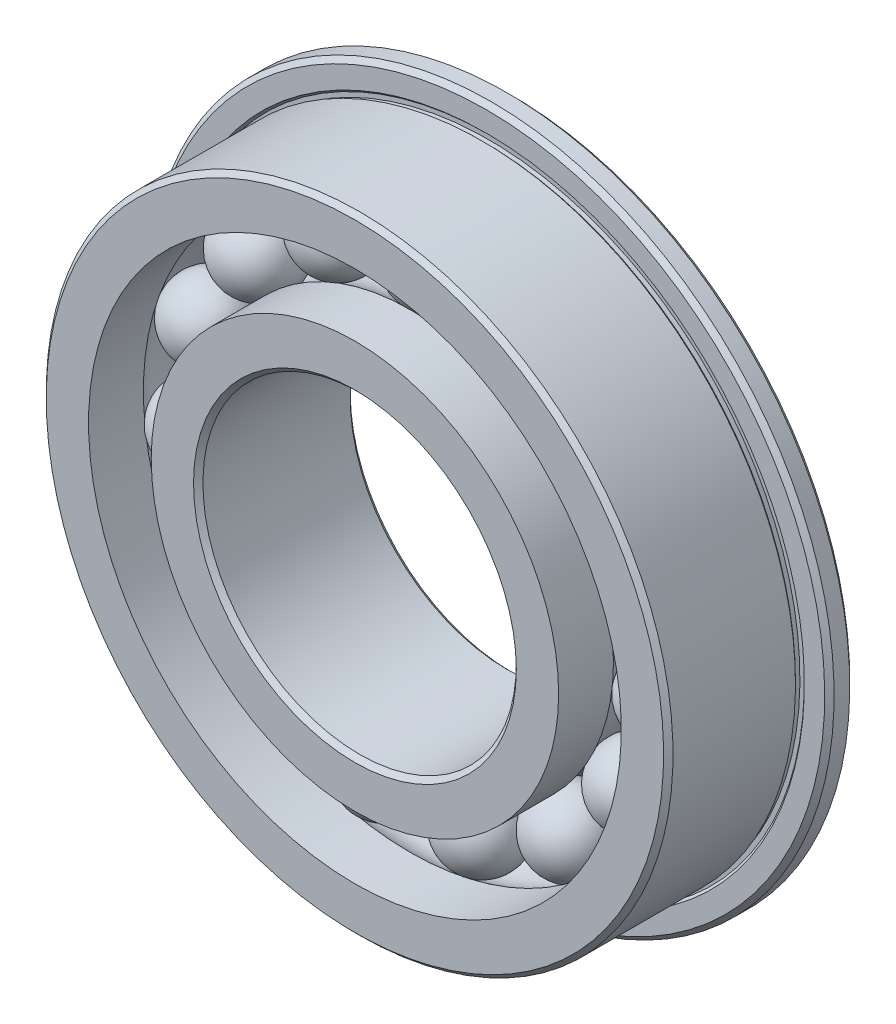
from build123d import *

# Parameters (mm, degrees)
FILLET1_SIZE      = 0.09525
FILLET2_SIZE      = 0.09525
CIRPATTERN3_COUNT = 15


with BuildPart() as part:
    # Sketch2 → Revolve1 (revolve)
    with BuildSketch(Plane(origin=(0, 0, 0), x_dir=(0, 0, -1), z_dir=(1, 0, 0)), mode=Mode.PRIVATE) as revolve1_sk:
        with BuildLine():
            Line((1.5875, 6.9469), (1.0795, 6.9469))
            Line((1.0795, 6.9469), (1.0795, 6.439802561))
            Line((1.0795, 6.439802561), (1.124401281, 6.394901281))
            Line((1.124401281, 6.394901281), (1.124401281, 6.305098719))
            Line((1.124401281, 6.305098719), (1.034598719, 6.305098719))
            Line((1.034598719, 6.305098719), (0.989697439, 6.35))
            Line((0.989697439, 6.35), (-1.5875, 6.35))
            Line((-1.5875, 6.35), (-1.5875, 5.3975))
            Line((-1.5875, 5.3975), (-0.47625, 5.3975))
            ThreePointArc((-0.47625, 5.3975), (0, 5.55625), (0.47625, 5.3975))
            Line((0.47625, 5.3975), (1.5875, 5.3975))
            Line((1.5875, 5.3975), (1.5875, 6.9469))
        make_face()
        with BuildLine():
            Line((1.5875, 3.175), (-1.5875, 3.175))
            Line((-1.5875, 3.175), (-1.5875, 4.1275))
            Line((-1.5875, 4.1275), (-0.47625, 4.1275))
            ThreePointArc((-0.47625, 4.1275), (0, 3.96875), (0.47625, 4.1275))
            Line((0.47625, 4.1275), (1.5875, 4.1275))
            Line((1.5875, 4.1275), (1.5875, 3.175))
        make_face()
    revolve(revolve1_sk.sketch.rotate(Axis((0, 0, 0), (0, 0, -1)), 180), axis=Axis((0, 0, 0), (0, 0, -1)))

    # Fillet1
    fillet1_edges = [part.edges().sort_by_distance(p)[0] for p in [
        (0, 6.35, 1.5875),
        (0, 6.9469, -1.5875),
        (0, 6.9469, -1.0795),
    ]]
    chamfer(fillet1_edges, length=FILLET1_SIZE)

    # Fillet2
    fillet2_edges = [part.edges().sort_by_distance(p)[0] for p in [
        (0, 3.175, -1.5875),
        (0, 3.175, 1.5875),
    ]]
    chamfer(fillet2_edges, length=FILLET2_SIZE)


with BuildPart() as body_2:
    # Sketch7 → Revolve3 (revolve)
    with BuildSketch(Plane.XY):
        with BuildLine():
            Line((0, 5.55625), (0, 3.96875))
            ThreePointArc((0, 3.96875), (-0.79375, 4.7625), (0, 5.55625))
        make_face()
    revolve(axis=Axis((0, 5.55625, 0), (0, -1, 0)))


with BuildPart() as cirpattern3_1:
    # CirPattern3: pattern copy
    add(body_2.part.rotate(Axis((0, 0, 0), (0, 0, 1)), 1 * 360 / CIRPATTERN3_COUNT))


with BuildPart() as cirpattern3_2:
    # CirPattern3: pattern copy
    add(body_2.part.rotate(Axis((0, 0, 0), (0, 0, 1)), 2 * 360 / CIRPATTERN3_COUNT))


with BuildPart() as cirpattern3_3:
    # CirPattern3: pattern copy
    add(body_2.part.rotate(Axis((0, 0, 0), (0, 0, 1)), 3 * 360 / CIRPATTERN3_COUNT))


with BuildPart() as cirpattern3_4:
    # CirPattern3: pattern copy
    add(body_2.part.rotate(Axis((0, 0, 0), (0, 0, 1)), 4 * 360 / CIRPATTERN3_COUNT))


with BuildPart() as cirpattern3_5:
    # CirPattern3: pattern copy
    add(body_2.part.rotate(Axis((0, 0, 0), (0, 0, 1)), 5 * 360 / CIRPATTERN3_COUNT))


with BuildPart() as cirpattern3_6:
    # CirPattern3: pattern copy
    add(body_2.part.rotate(Axis((0, 0, 0), (0, 0, 1)), 6 * 360 / CIRPATTERN3_COUNT))


with BuildPart() as cirpattern3_7:
    # CirPattern3: pattern copy
    add(body_2.part.rotate(Axis((0, 0, 0), (0, 0, 1)), 7 * 360 / CIRPATTERN3_COUNT))


with BuildPart() as cirpattern3_8:
    # CirPattern3: pattern copy
    add(body_2.part.rotate(Axis((0, 0, 0), (0, 0, 1)), 8 * 360 / CIRPATTERN3_COUNT))


with BuildPart() as cirpattern3_9:
    # CirPattern3: pattern copy
    add(body_2.part.rotate(Axis((0, 0, 0), (0, 0, 1)), 9 * 360 / CIRPATTERN3_COUNT))


with BuildPart() as cirpattern3_10:
    # CirPattern3: pattern copy
    add(body_2.part.rotate(Axis((0, 0, 0), (0, 0, 1)), 10 * 360 / CIRPATTERN3_COUNT))


with BuildPart() as cirpattern3_11:
    # CirPattern3: pattern copy
    add(body_2.part.rotate(Axis((0, 0, 0), (0, 0, 1)), 11 * 360 / CIRPATTERN3_COUNT))


with BuildPart() as cirpattern3_12:
    # CirPattern3: pattern copy
    add(body_2.part.rotate(Axis((0, 0, 0), (0, 0, 1)), 12 * 360 / CIRPATTERN3_COUNT))


with BuildPart() as cirpattern3_13:
    # CirPattern3: pattern copy
    add(body_2.part.rotate(Axis((0, 0, 0), (0, 0, 1)), 13 * 360 / CIRPATTERN3_COUNT))


with BuildPart() as cirpattern3_14:
    # CirPattern3: pattern copy
    add(body_2.part.rotate(Axis((0, 0, 0), (0, 0, 1)), 14 * 360 / CIRPATTERN3_COUNT))


solid = Compound([part.part, body_2.part, cirpattern3_1.part, cirpattern3_2.part, cirpattern3_3.part, cirpattern3_4.part, cirpattern3_5.part, cirpattern3_6.part, cirpattern3_7.part, cirpattern3_8.part, cirpattern3_9.part, cirpattern3_10.part, cirpattern3_11.part, cirpattern3_12.part, cirpattern3_13.part, cirpattern3_14.part])
